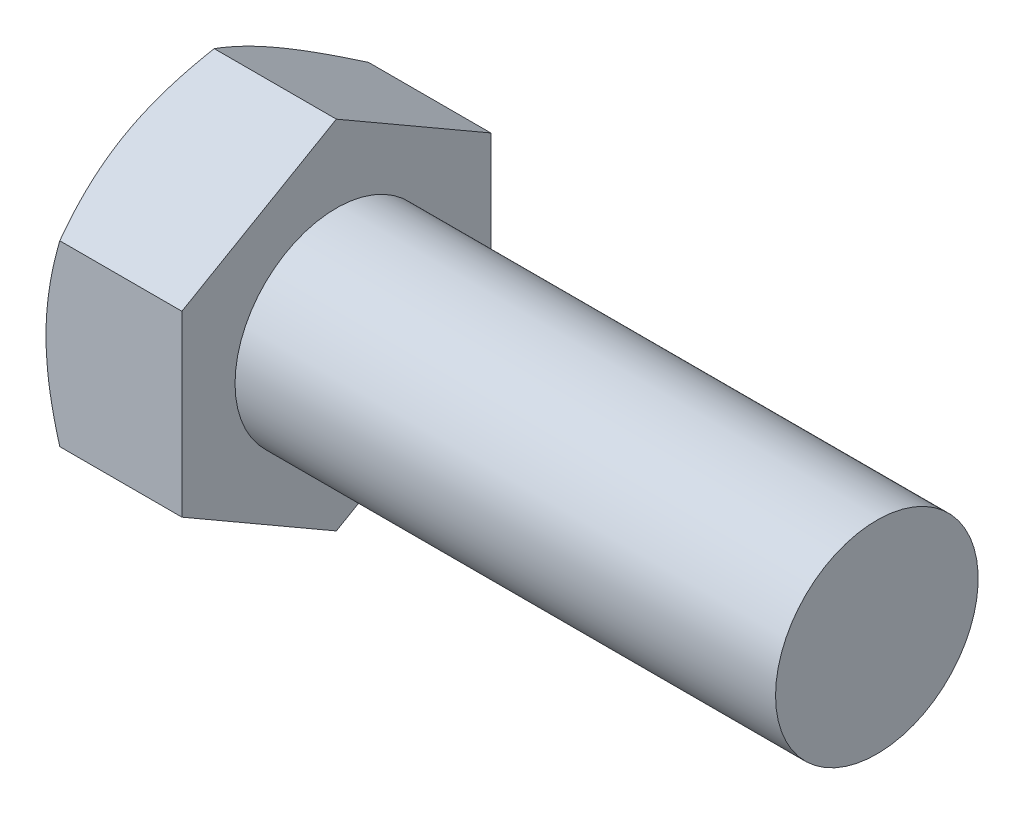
from build123d import *

# Parameters (mm, degrees)
SKETCH2_R     = 3.702944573
HEX_DIE_DEPTH = 2.794


with BuildPart() as part:
    # BodySke → Base-Revolve (revolve)
    with BuildSketch(Plane.XY, mode=Mode.PRIVATE) as base_revolve_sk:
        Polygon((2.794, 2.0828), (2.794, 3.666281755), (0.283641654, 3.666281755), (0, 3.175), (0, 0), (13.9065, 0), (13.9065, 2.0828), align=None)
    revolve(base_revolve_sk.sketch.rotate(Axis((-25.4, 0, 0), (1, 0, 0)), 90), axis=Axis((-25.4, 0, 0), (1, 0, 0)))

    # Sketch2 → Hex-Die (cut)
    with BuildSketch(Plane(origin=(0, 0, 0), x_dir=(0, 0, -1), z_dir=(1, 0, 0))):
        Circle(SKETCH2_R)
        Polygon((-3.175, 1.833087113), (0, 3.666174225), (3.175, 1.833087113), (3.175, -1.833087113), (0, -3.666174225), (-3.175, -1.833087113), align=None, mode=Mode.SUBTRACT)
    extrude(amount=HEX_DIE_DEPTH, mode=Mode.SUBTRACT)


solid = part.part
